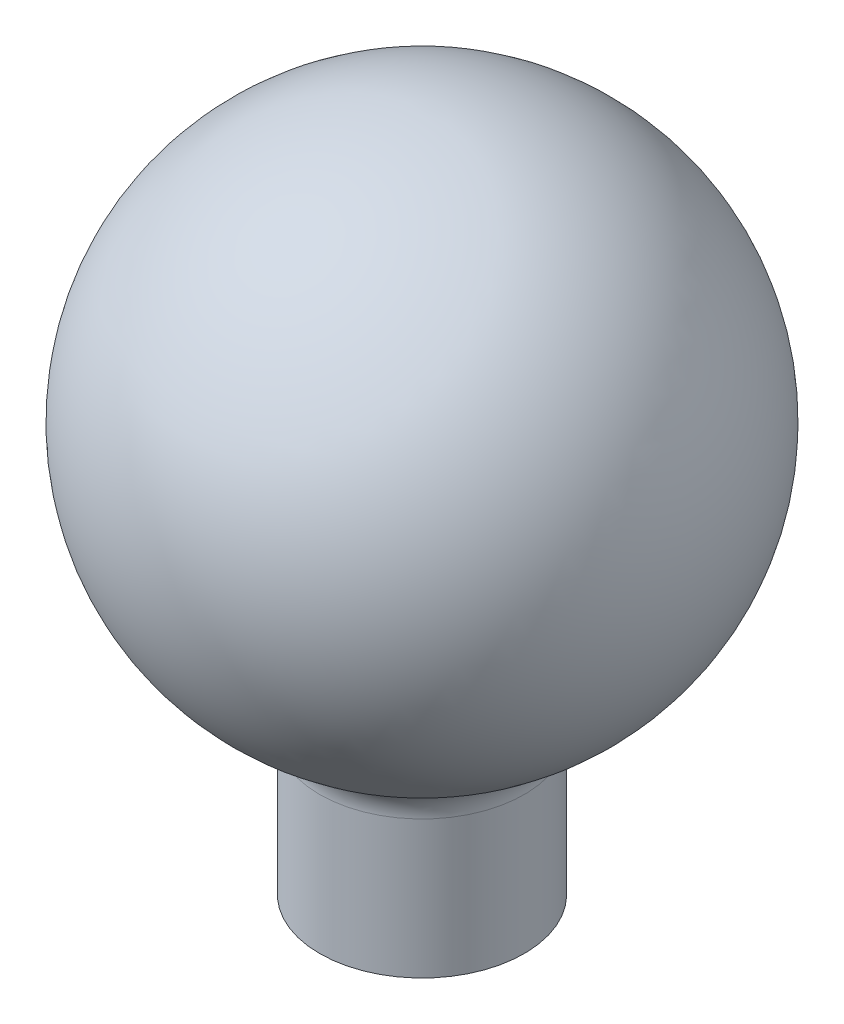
from build123d import *

# Parameters (mm, degrees)
SKETCH1_R      = 12.5
EXTRUDE1_DEPTH = 20
FILLET1_R      = 5


with BuildPart() as part:
    # Sketch1 → Extrude1 (new body)
    with BuildSketch(Plane(origin=(0, 0, 0), x_dir=(1, 0, 0), z_dir=(0, 1, 0))):
        with Locations(Location((0, 0, 0), (0, 0, 270))):
            Circle(SKETCH1_R)
        with BuildLine():
            Line((4.5, 6), (4.5, -6))
            ThreePointArc((4.5, -6), (-7.5, 0), (4.5, 6))
        make_face(mode=Mode.SUBTRACT)
    extrude(amount=EXTRUDE1_DEPTH)

    # Sketch3 → Revolve1 (revolve)
    with BuildSketch(Plane.XY):
        with BuildLine():
            Line((12.5, 20), (0, 20))
            Line((0, 20), (0, 82.5))
            ThreePointArc((0, 82.5), (31.86887196, 56.373774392), (12.5, 20))
        make_face()
    revolve(axis=Axis((0, 20, 0), (0, 1, 0)))

    # Fillet1
    fillet1_edges = [part.edges().sort_by_distance(p)[0] for p in [
        (-8.838834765, 20, -8.838834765),
    ]]
    fillet(fillet1_edges, radius=FILLET1_R)


solid = part.part
